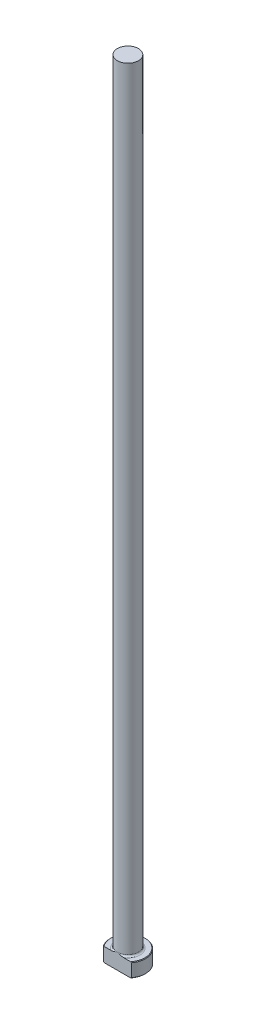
from build123d import *

# Parameters (mm, degrees)
CHAMFER1_SIZE = 0.254
FILLET1_R     = 0.762
KEY_DEPTH     = 356.777132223


with BuildPart() as part:
    # Sketch1 → Revolve1 (revolve)
    with BuildSketch(Plane.XY, mode=Mode.PRIVATE) as revolve1_sk:
        Polygon((0, 0), (-7.9375, 0), (-7.9375, 6.35), (-4.7625, 6.35), (-4.7625, 355.6), (0, 355.6), align=None)
    revolve(revolve1_sk.sketch.rotate(Axis((0, 259.958771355, 0), (0, -1, 0)), 270), axis=Axis((0, 259.958771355, 0), (0, -1, 0)))

    # Chamfer1
    chamfer1_edges = [part.edges().sort_by_distance(p)[0] for p in [
        (0, 6.35, -7.9375),
        (0, 0, -7.9375),
    ]]
    chamfer(chamfer1_edges, length=CHAMFER1_SIZE)

    # Fillet1
    fillet1_edges = [part.edges().sort_by_distance(p)[0] for p in [
        (0, 6.35, -4.7625),
    ]]
    fillet(fillet1_edges, radius=FILLET1_R)

    # Sketch2 → KEY (cut, through all)
    with BuildSketch(Plane.XZ):
        with BuildLine():
            Line((-6.35, 4.7625), (6.35, 4.7625))
            ThreePointArc((6.35, 4.7625), (0, 7.9375), (-6.35, 4.7625))
        make_face()
    extrude(amount=-KEY_DEPTH, mode=Mode.SUBTRACT)


solid = part.part
